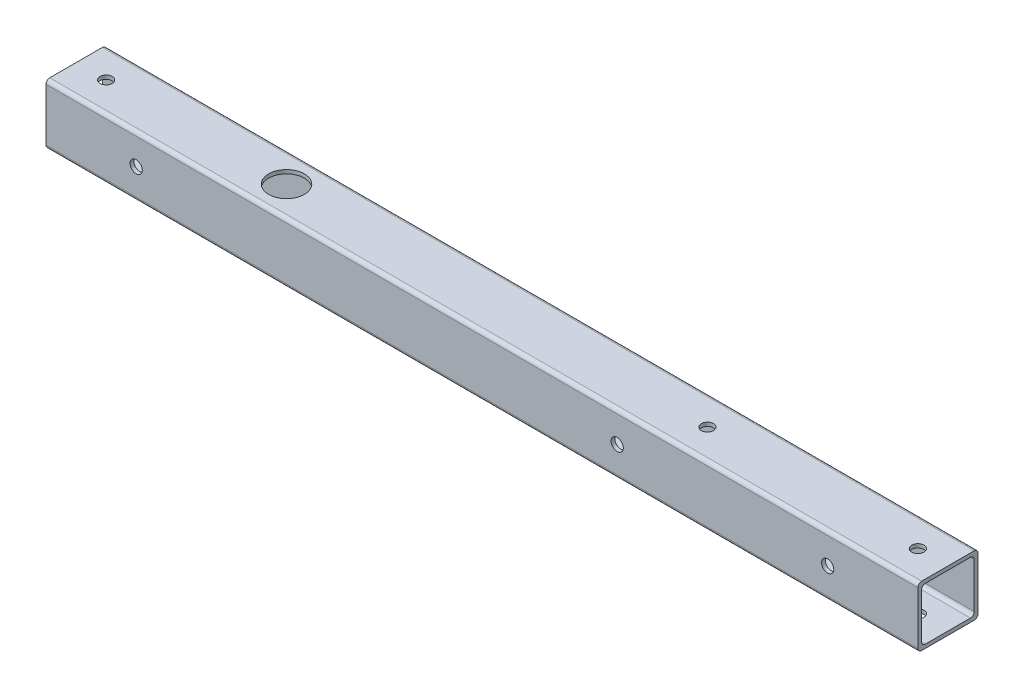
from build123d import *

# Parameters (mm, degrees)
SKETCH1_W          = 1473.2
SKETCH1_H          = 101.6
EXTRUDE1_DEPTH     = 101.6
CUT_EXTRUDE1_REACH = 1482.19
SKETCH2_W          = 88.9
SKETCH2_H          = 88.9
FILLET1_R          = 6.35
SKETCH3_R          = 10.31875
CUT_EXTRUDE2_DEPTH = 101.6
SKETCH4_R          = 10.31875
CUT_EXTRUDE3_DEPTH = 101.6
SKETCH5_R          = 30.1625
CUT_EXTRUDE4_DEPTH = 101.6
SKETCH6_R          = 10.31875
CUT_EXTRUDE5_DEPTH = 101.6
SKETCH7_R          = 10.31875
CUT_EXTRUDE6_DEPTH = 101.6
SKETCH8_R          = 10.31875
CUT_EXTRUDE7_DEPTH = 101.6
SKETCH9_R          = 10.31875
CUT_EXTRUDE8_DEPTH = 101.6


with BuildPart() as part:
    # Sketch1 → Extrude1 (new body)
    with BuildSketch(Plane(origin=(0, 0, 0), x_dir=(1, 0, 0), z_dir=(0, 1, 0))):
        with Locations((-736.6, -50.8)):
            Rectangle(SKETCH1_W, SKETCH1_H)
    extrude(amount=EXTRUDE1_DEPTH)

    # Sketch2 → Cut-Extrude1 (cut, up to next)
    with BuildSketch(Plane.ZY.offset(1473.2), mode=Mode.PRIVATE) as cut_extrude1_sk1:
        with Locations((50.8, 50.8)):
            Rectangle(SKETCH2_W, SKETCH2_H)
    cut_extrude1_tool1 = extrude(cut_extrude1_sk1.sketch, amount=-CUT_EXTRUDE1_REACH, mode=Mode.PRIVATE) & part.part
    add(cut_extrude1_tool1.solids().sort_by_distance((-1473.2, 50.8, 50.8))[0], mode=Mode.SUBTRACT)

    # Fillet1
    fillet1_edges = [part.edges().sort_by_distance(p)[0] for p in [
        (-736.6, 101.6, 101.6),
        (-736.6, 6.35, 6.35),
        (-736.6, 95.25, 6.35),
        (-736.6, 95.25, 95.25),
        (-736.6, 6.35, 95.25),
        (-736.6, 0, 101.6),
        (-736.6, 0, 0),
        (-736.6, 101.6, 0),
    ]]
    fillet(fillet1_edges, radius=FILLET1_R)

    # Sketch3 → Cut-Extrude2 (cut)
    with BuildSketch(Plane(origin=(0, 101.6, 0), x_dir=(1, 0, 0), z_dir=(0, 1, 0))):
        with Locations(Location((-1422.4, -50.8, 0), (0, 0, 270))):
            Circle(SKETCH3_R)
    extrude(amount=-CUT_EXTRUDE2_DEPTH, mode=Mode.SUBTRACT)

    # Sketch4 → Cut-Extrude3 (cut)
    with BuildSketch(Plane(origin=(0, 101.6, 0), x_dir=(1, 0, 0), z_dir=(0, 1, 0))):
        with Locations(Location((-50.8, -50.8, 0), (0, 0, 270))):
            Circle(SKETCH4_R)
    extrude(amount=-CUT_EXTRUDE3_DEPTH, mode=Mode.SUBTRACT)

    # Sketch5 → Cut-Extrude4 (cut)
    with BuildSketch(Plane(origin=(0, 101.6, 0), x_dir=(1, 0, 0), z_dir=(0, 1, 0))):
        with Locations(Location((-1117.6, -50.8, 0), (0, 0, 270))):
            Circle(SKETCH5_R)
    extrude(amount=-CUT_EXTRUDE4_DEPTH, mode=Mode.SUBTRACT)

    # Sketch6 → Cut-Extrude5 (cut)
    with BuildSketch(Plane(origin=(0, 0, 0), x_dir=(-1, 0, 0), z_dir=(0, 0, -1))):
        with Locations((1320.8, 50.8)):
            Circle(SKETCH6_R)
    extrude(amount=-CUT_EXTRUDE5_DEPTH, mode=Mode.SUBTRACT)

    # Sketch7 → Cut-Extrude6 (cut)
    with BuildSketch(Plane(origin=(0, 0, 0), x_dir=(-1, 0, 0), z_dir=(0, 0, -1))):
        with Locations((152.4, 50.8)):
            Circle(SKETCH7_R)
    extrude(amount=-CUT_EXTRUDE6_DEPTH, mode=Mode.SUBTRACT)

    # Sketch8 → Cut-Extrude7 (cut)
    with BuildSketch(Plane(origin=(0, 0, 0), x_dir=(-1, 0, 0), z_dir=(0, 0, -1))):
        with Locations((508, 50.8)):
            Circle(SKETCH8_R)
    extrude(amount=-CUT_EXTRUDE7_DEPTH, mode=Mode.SUBTRACT)

    # Sketch9 → Cut-Extrude8 (cut)
    with BuildSketch(Plane(origin=(0, 101.6, 0), x_dir=(1, 0, 0), z_dir=(0, 1, 0))):
        with Locations(Location((-406.4, -50.8, 0), (0, 0, 270))):
            Circle(SKETCH9_R)
    extrude(amount=-CUT_EXTRUDE8_DEPTH, mode=Mode.SUBTRACT)


solid = part.part
